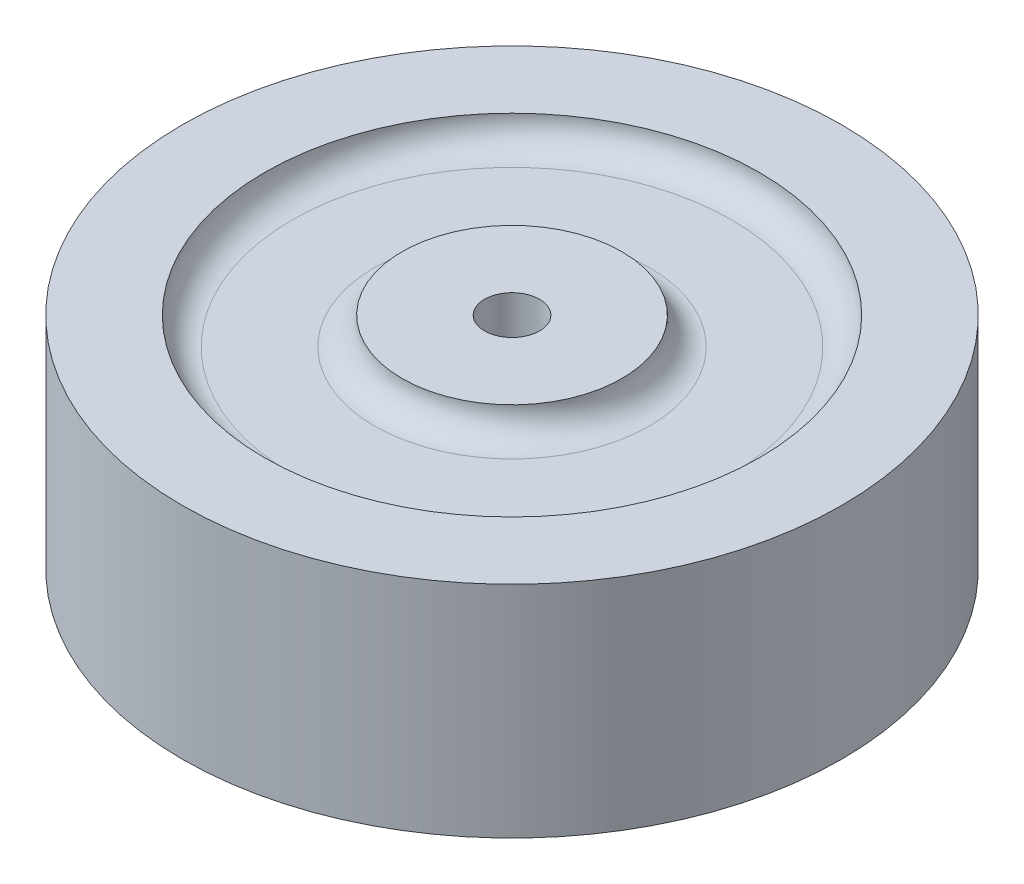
ISO-10303-21;
HEADER;
FILE_DESCRIPTION(('STEP AP214'),'2;1');
FILE_NAME('part.step','',(''),(''),'','','');
FILE_SCHEMA(('AUTOMOTIVE_DESIGN { 1 0 10303 214 1 1 1 1 }'));
ENDSEC;
DATA;
#1=APPLICATION_CONTEXT('core data for automotive mechanical design processes');
#2=APPLICATION_PROTOCOL_DEFINITION('international standard','automotive_design',2000,#1);
#3=PRODUCT_CONTEXT('',#1,'mechanical');
#4=PRODUCT('Part','Part','',(#3));
#5=PRODUCT_RELATED_PRODUCT_CATEGORY('part','',(#4));
#6=PRODUCT_DEFINITION_FORMATION('','',#4);
#7=PRODUCT_DEFINITION_CONTEXT('part definition',#1,'design');
#8=PRODUCT_DEFINITION('design','',#6,#7);
#9=PRODUCT_DEFINITION_SHAPE('','',#8);
#10=(LENGTH_UNIT() NAMED_UNIT(*) SI_UNIT(.MILLI.,.METRE.));
#11=(NAMED_UNIT(*) PLANE_ANGLE_UNIT() SI_UNIT($,.RADIAN.));
#12=(NAMED_UNIT(*) SI_UNIT($,.STERADIAN.) SOLID_ANGLE_UNIT());
#13=UNCERTAINTY_MEASURE_WITH_UNIT(LENGTH_MEASURE(1.E-05),#10,'distance_accuracy_value','');
#14=(GEOMETRIC_REPRESENTATION_CONTEXT(3) GLOBAL_UNCERTAINTY_ASSIGNED_CONTEXT((#13)) GLOBAL_UNIT_ASSIGNED_CONTEXT((#10,
#11,#12)) REPRESENTATION_CONTEXT('',''));
#15=CARTESIAN_POINT('',(0.,0.,0.));
#16=DIRECTION('',(0.,0.,1.));
#17=DIRECTION('',(1.,0.,0.));
#18=AXIS2_PLACEMENT_3D('',#15,#16,#17);
#19=CARTESIAN_POINT('',(0.,0.,0.));
#20=DIRECTION('',(0.,1.,0.));
#21=DIRECTION('',(0.,0.,1.));
#22=AXIS2_PLACEMENT_3D('',#19,#20,#21);
#23=PLANE('',#22);
#24=CARTESIAN_POINT('',(0.,0.,0.));
#25=DIRECTION('',(0.,1.,0.));
#26=DIRECTION('',(0.,0.,1.));
#27=AXIS2_PLACEMENT_3D('',#24,#25,#26);
#28=CIRCLE('',#27,25.4);
#29=CARTESIAN_POINT('',(0.,0.,25.4));
#30=VERTEX_POINT('',#29);
#31=EDGE_CURVE('E10',#30,#30,#28,.F.);
#32=ORIENTED_EDGE('',*,*,#31,.T.);
#33=EDGE_LOOP('',(#32));
#34=FACE_BOUND('',#33,.T.);
#35=CARTESIAN_POINT('',(0.,0.,0.));
#36=DIRECTION('',(0.,1.,0.));
#37=DIRECTION('',(0.,0.,1.));
#38=AXIS2_PLACEMENT_3D('',#35,#36,#37);
#39=CIRCLE('',#38,15.875);
#40=CARTESIAN_POINT('',(0.,0.,15.875));
#41=VERTEX_POINT('',#40);
#42=EDGE_CURVE('E45',#41,#41,#39,.T.);
#43=ORIENTED_EDGE('',*,*,#42,.T.);
#44=EDGE_LOOP('',(#43));
#45=FACE_BOUND('',#44,.T.);
#46=ADVANCED_FACE('F37',(#34,#45),#23,.F.);
#47=CARTESIAN_POINT('',(0.,19.05,0.));
#48=DIRECTION('',(0.,1.,0.));
#49=DIRECTION('',(0.,0.,1.));
#50=AXIS2_PLACEMENT_3D('',#47,#48,#49);
#51=PLANE('',#50);
#52=CARTESIAN_POINT('',(0.,19.05,0.));
#53=DIRECTION('',(0.,1.,0.));
#54=DIRECTION('',(0.,0.,1.));
#55=AXIS2_PLACEMENT_3D('',#52,#53,#54);
#56=CIRCLE('',#55,15.875);
#57=CARTESIAN_POINT('',(0.,19.05,15.875));
#58=VERTEX_POINT('',#57);
#59=EDGE_CURVE('E50',#58,#58,#56,.F.);
#60=ORIENTED_EDGE('',*,*,#59,.T.);
#61=EDGE_LOOP('',(#60));
#62=FACE_BOUND('',#61,.T.);
#63=CARTESIAN_POINT('',(0.,19.05,0.));
#64=DIRECTION('',(0.,1.,0.));
#65=DIRECTION('',(0.,0.,1.));
#66=AXIS2_PLACEMENT_3D('',#63,#64,#65);
#67=CIRCLE('',#66,25.4);
#68=CARTESIAN_POINT('',(0.,19.05,25.4));
#69=VERTEX_POINT('',#68);
#70=EDGE_CURVE('E55',#69,#69,#67,.T.);
#71=ORIENTED_EDGE('',*,*,#70,.T.);
#72=EDGE_LOOP('',(#71));
#73=FACE_BOUND('',#72,.T.);
#74=ADVANCED_FACE('F113',(#62,#73),#51,.T.);
#75=CARTESIAN_POINT('',(0.,19.05,0.));
#76=DIRECTION('',(0.,-1.,0.));
#77=DIRECTION('',(0.,0.,-1.));
#78=AXIS2_PLACEMENT_3D('',#75,#76,#77);
#79=CYLINDRICAL_SURFACE('',#78,38.1);
#80=CARTESIAN_POINT('',(0.,22.225,0.));
#81=DIRECTION('',(0.,1.,0.));
#82=DIRECTION('',(0.,0.,1.));
#83=AXIS2_PLACEMENT_3D('',#80,#81,#82);
#84=CIRCLE('',#83,38.1);
#85=CARTESIAN_POINT('',(0.,22.225,-38.1));
#86=VERTEX_POINT('',#85);
#87=EDGE_CURVE('E61',#86,#86,#84,.T.);
#88=CARTESIAN_POINT('',(0.,-3.175,0.));
#89=DIRECTION('',(0.,-1.,0.));
#90=DIRECTION('',(0.,0.,-1.));
#91=AXIS2_PLACEMENT_3D('',#88,#89,#90);
#92=CIRCLE('',#91,38.1);
#93=CARTESIAN_POINT('',(0.,-3.175,-38.1));
#94=VERTEX_POINT('',#93);
#95=EDGE_CURVE('E69',#94,#94,#92,.T.);
#96=CARTESIAN_POINT('',(0.,22.225,-38.1));
#97=CARTESIAN_POINT('',(0.,21.9604166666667,-38.1));
#98=CARTESIAN_POINT('',(0.,21.6958333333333,-38.1));
#99=CARTESIAN_POINT('',(0.,21.1666666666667,-38.1));
#100=CARTESIAN_POINT('',(0.,20.9020833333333,-38.1));
#101=CARTESIAN_POINT('',(0.,20.3729166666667,-38.1));
#102=CARTESIAN_POINT('',(0.,20.1083333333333,-38.1));
#103=CARTESIAN_POINT('',(0.,19.5791666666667,-38.1));
#104=CARTESIAN_POINT('',(0.,19.3145833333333,-38.1));
#105=CARTESIAN_POINT('',(0.,18.7854166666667,-38.1));
#106=CARTESIAN_POINT('',(0.,18.5208333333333,-38.1));
#107=CARTESIAN_POINT('',(0.,17.9916666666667,-38.1));
#108=CARTESIAN_POINT('',(0.,17.7270833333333,-38.1));
#109=CARTESIAN_POINT('',(0.,17.1979166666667,-38.1));
#110=CARTESIAN_POINT('',(0.,16.9333333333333,-38.1));
#111=CARTESIAN_POINT('',(0.,16.4041666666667,-38.1));
#112=CARTESIAN_POINT('',(0.,16.1395833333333,-38.1));
#113=CARTESIAN_POINT('',(0.,15.6104166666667,-38.1));
#114=CARTESIAN_POINT('',(0.,15.3458333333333,-38.1));
#115=CARTESIAN_POINT('',(0.,14.8166666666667,-38.1));
#116=CARTESIAN_POINT('',(0.,14.5520833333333,-38.1));
#117=CARTESIAN_POINT('',(0.,14.0229166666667,-38.1));
#118=CARTESIAN_POINT('',(0.,13.7583333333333,-38.1));
#119=CARTESIAN_POINT('',(0.,13.2291666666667,-38.1));
#120=CARTESIAN_POINT('',(0.,12.9645833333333,-38.1));
#121=CARTESIAN_POINT('',(0.,12.4354166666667,-38.1));
#122=CARTESIAN_POINT('',(0.,12.1708333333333,-38.1));
#123=CARTESIAN_POINT('',(0.,11.6416666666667,-38.1));
#124=CARTESIAN_POINT('',(0.,11.3770833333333,-38.1));
#125=CARTESIAN_POINT('',(0.,10.8479166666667,-38.1));
#126=CARTESIAN_POINT('',(0.,10.5833333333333,-38.1));
#127=CARTESIAN_POINT('',(0.,10.0541666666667,-38.1));
#128=CARTESIAN_POINT('',(0.,9.78958333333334,-38.1));
#129=CARTESIAN_POINT('',(0.,9.26041666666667,-38.1));
#130=CARTESIAN_POINT('',(0.,8.99583333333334,-38.1));
#131=CARTESIAN_POINT('',(0.,8.46666666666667,-38.1));
#132=CARTESIAN_POINT('',(0.,8.20208333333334,-38.1));
#133=CARTESIAN_POINT('',(0.,7.67291666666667,-38.1));
#134=CARTESIAN_POINT('',(0.,7.40833333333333,-38.1));
#135=CARTESIAN_POINT('',(0.,6.87916666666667,-38.1));
#136=CARTESIAN_POINT('',(0.,6.61458333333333,-38.1));
#137=CARTESIAN_POINT('',(0.,6.08541666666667,-38.1));
#138=CARTESIAN_POINT('',(0.,5.82083333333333,-38.1));
#139=CARTESIAN_POINT('',(0.,5.29166666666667,-38.1));
#140=CARTESIAN_POINT('',(0.,5.02708333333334,-38.1));
#141=CARTESIAN_POINT('',(0.,4.49791666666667,-38.1));
#142=CARTESIAN_POINT('',(0.,4.23333333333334,-38.1));
#143=CARTESIAN_POINT('',(0.,3.70416666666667,-38.1));
#144=CARTESIAN_POINT('',(0.,3.43958333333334,-38.1));
#145=CARTESIAN_POINT('',(0.,2.91041666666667,-38.1));
#146=CARTESIAN_POINT('',(0.,2.64583333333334,-38.1));
#147=CARTESIAN_POINT('',(0.,2.11666666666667,-38.1));
#148=CARTESIAN_POINT('',(0.,1.85208333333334,-38.1));
#149=CARTESIAN_POINT('',(0.,1.32291666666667,-38.1));
#150=CARTESIAN_POINT('',(0.,1.05833333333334,-38.1));
#151=CARTESIAN_POINT('',(0.,0.529166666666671,-38.1));
#152=CARTESIAN_POINT('',(0.,0.264583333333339,-38.1));
#153=CARTESIAN_POINT('',(0.,-0.264583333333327,-38.1));
#154=CARTESIAN_POINT('',(0.,-0.529166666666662,-38.1));
#155=CARTESIAN_POINT('',(0.,-1.05833333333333,-38.1));
#156=CARTESIAN_POINT('',(0.,-1.32291666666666,-38.1));
#157=CARTESIAN_POINT('',(0.,-1.85208333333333,-38.1));
#158=CARTESIAN_POINT('',(0.,-2.11666666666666,-38.1));
#159=CARTESIAN_POINT('',(0.,-2.64583333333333,-38.1));
#160=CARTESIAN_POINT('',(0.,-2.91041666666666,-38.1));
#161=CARTESIAN_POINT('',(0.,-3.175,-38.1));
#162=B_SPLINE_CURVE_WITH_KNOTS('',3,(#96,#97,#98,#99,#100,#101,#102,#103,#104,#105,#106,#107,
#108,#109,#110,#111,#112,#113,#114,#115,#116,#117,#118,#119,#120,#121,#122,#123,#124,#125,#126,
#127,#128,#129,#130,#131,#132,#133,#134,#135,#136,#137,#138,#139,#140,#141,#142,#143,#144,#145,
#146,#147,#148,#149,#150,#151,#152,#153,#154,#155,#156,#157,#158,#159,#160,#161),.UNSPECIFIED.,
.F.,.F.,(4,2,2,2,2,2,2,2,2,2,2,2,2,2,2,2,2,2,2,2,2,2,2,2,2,2,2,2,2,2,2,2,4),(0.,
0.793749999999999,1.5875,2.38125,3.175,3.96875,4.7625,5.55625,6.35,7.14375,7.9375,8.73125,9.525,
10.31875,11.1125,11.90625,12.7,13.49375,14.2875,15.08125,15.875,16.66875,17.4625,18.25625,19.05,
19.84375,20.6375,21.43125,22.225,23.01875,23.8125,24.60625,25.4),.UNSPECIFIED.);
#163=EDGE_CURVE('BSEAM118',#86,#94,#162,.T.);
#164=ORIENTED_EDGE('',*,*,#87,.F.);
#165=ORIENTED_EDGE('',*,*,#95,.F.);
#166=ORIENTED_EDGE('',*,*,#163,.T.);
#167=ORIENTED_EDGE('',*,*,#163,.F.);
#168=EDGE_LOOP('',(#164,#166,#165,#167));
#169=FACE_BOUND('',#168,.T.);
#170=ADVANCED_FACE('F118',(#169),#79,.T.);
#171=CARTESIAN_POINT('',(0.,19.05,0.));
#172=DIRECTION('',(0.,-1.,0.));
#173=DIRECTION('',(0.,0.,-1.));
#174=AXIS2_PLACEMENT_3D('',#171,#172,#173);
#175=CYLINDRICAL_SURFACE('',#174,3.175);
#176=CARTESIAN_POINT('',(0.,22.225,0.));
#177=DIRECTION('',(0.,1.,0.));
#178=DIRECTION('',(0.,0.,1.));
#179=AXIS2_PLACEMENT_3D('',#176,#177,#178);
#180=CIRCLE('',#179,3.175);
#181=CARTESIAN_POINT('',(0.,22.225,-3.175));
#182=VERTEX_POINT('',#181);
#183=EDGE_CURVE('E81',#182,#182,#180,.T.);
#184=CARTESIAN_POINT('',(0.,-3.175,0.));
#185=DIRECTION('',(0.,-1.,0.));
#186=DIRECTION('',(0.,0.,-1.));
#187=AXIS2_PLACEMENT_3D('',#184,#185,#186);
#188=CIRCLE('',#187,3.175);
#189=CARTESIAN_POINT('',(0.,-3.175,-3.175));
#190=VERTEX_POINT('',#189);
#191=EDGE_CURVE('E89',#190,#190,#188,.T.);
#192=CARTESIAN_POINT('',(0.,22.225,-3.175));
#193=CARTESIAN_POINT('',(0.,21.9604166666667,-3.175));
#194=CARTESIAN_POINT('',(0.,21.6958333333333,-3.175));
#195=CARTESIAN_POINT('',(0.,21.1666666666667,-3.175));
#196=CARTESIAN_POINT('',(0.,20.9020833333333,-3.175));
#197=CARTESIAN_POINT('',(0.,20.3729166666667,-3.175));
#198=CARTESIAN_POINT('',(0.,20.1083333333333,-3.175));
#199=CARTESIAN_POINT('',(0.,19.5791666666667,-3.175));
#200=CARTESIAN_POINT('',(0.,19.3145833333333,-3.175));
#201=CARTESIAN_POINT('',(0.,18.7854166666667,-3.175));
#202=CARTESIAN_POINT('',(0.,18.5208333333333,-3.175));
#203=CARTESIAN_POINT('',(0.,17.9916666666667,-3.175));
#204=CARTESIAN_POINT('',(0.,17.7270833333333,-3.175));
#205=CARTESIAN_POINT('',(0.,17.1979166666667,-3.175));
#206=CARTESIAN_POINT('',(0.,16.9333333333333,-3.175));
#207=CARTESIAN_POINT('',(0.,16.4041666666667,-3.175));
#208=CARTESIAN_POINT('',(0.,16.1395833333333,-3.175));
#209=CARTESIAN_POINT('',(0.,15.6104166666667,-3.175));
#210=CARTESIAN_POINT('',(0.,15.3458333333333,-3.175));
#211=CARTESIAN_POINT('',(0.,14.8166666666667,-3.175));
#212=CARTESIAN_POINT('',(0.,14.5520833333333,-3.175));
#213=CARTESIAN_POINT('',(0.,14.0229166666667,-3.175));
#214=CARTESIAN_POINT('',(0.,13.7583333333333,-3.175));
#215=CARTESIAN_POINT('',(0.,13.2291666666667,-3.175));
#216=CARTESIAN_POINT('',(0.,12.9645833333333,-3.175));
#217=CARTESIAN_POINT('',(0.,12.4354166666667,-3.175));
#218=CARTESIAN_POINT('',(0.,12.1708333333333,-3.175));
#219=CARTESIAN_POINT('',(0.,11.6416666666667,-3.175));
#220=CARTESIAN_POINT('',(0.,11.3770833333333,-3.175));
#221=CARTESIAN_POINT('',(0.,10.8479166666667,-3.175));
#222=CARTESIAN_POINT('',(0.,10.5833333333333,-3.175));
#223=CARTESIAN_POINT('',(0.,10.0541666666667,-3.175));
#224=CARTESIAN_POINT('',(0.,9.78958333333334,-3.175));
#225=CARTESIAN_POINT('',(0.,9.26041666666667,-3.175));
#226=CARTESIAN_POINT('',(0.,8.99583333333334,-3.175));
#227=CARTESIAN_POINT('',(0.,8.46666666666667,-3.175));
#228=CARTESIAN_POINT('',(0.,8.20208333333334,-3.175));
#229=CARTESIAN_POINT('',(0.,7.67291666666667,-3.175));
#230=CARTESIAN_POINT('',(0.,7.40833333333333,-3.175));
#231=CARTESIAN_POINT('',(0.,6.87916666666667,-3.175));
#232=CARTESIAN_POINT('',(0.,6.61458333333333,-3.175));
#233=CARTESIAN_POINT('',(0.,6.08541666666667,-3.175));
#234=CARTESIAN_POINT('',(0.,5.82083333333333,-3.175));
#235=CARTESIAN_POINT('',(0.,5.29166666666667,-3.175));
#236=CARTESIAN_POINT('',(0.,5.02708333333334,-3.175));
#237=CARTESIAN_POINT('',(0.,4.49791666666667,-3.175));
#238=CARTESIAN_POINT('',(0.,4.23333333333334,-3.175));
#239=CARTESIAN_POINT('',(0.,3.70416666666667,-3.175));
#240=CARTESIAN_POINT('',(0.,3.43958333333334,-3.175));
#241=CARTESIAN_POINT('',(0.,2.91041666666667,-3.175));
#242=CARTESIAN_POINT('',(0.,2.64583333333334,-3.175));
#243=CARTESIAN_POINT('',(0.,2.11666666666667,-3.175));
#244=CARTESIAN_POINT('',(0.,1.85208333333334,-3.175));
#245=CARTESIAN_POINT('',(0.,1.32291666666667,-3.175));
#246=CARTESIAN_POINT('',(0.,1.05833333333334,-3.175));
#247=CARTESIAN_POINT('',(0.,0.529166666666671,-3.175));
#248=CARTESIAN_POINT('',(0.,0.264583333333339,-3.175));
#249=CARTESIAN_POINT('',(0.,-0.264583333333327,-3.175));
#250=CARTESIAN_POINT('',(0.,-0.529166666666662,-3.175));
#251=CARTESIAN_POINT('',(0.,-1.05833333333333,-3.175));
#252=CARTESIAN_POINT('',(0.,-1.32291666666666,-3.175));
#253=CARTESIAN_POINT('',(0.,-1.85208333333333,-3.175));
#254=CARTESIAN_POINT('',(0.,-2.11666666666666,-3.175));
#255=CARTESIAN_POINT('',(0.,-2.64583333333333,-3.175));
#256=CARTESIAN_POINT('',(0.,-2.91041666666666,-3.175));
#257=CARTESIAN_POINT('',(0.,-3.175,-3.175));
#258=B_SPLINE_CURVE_WITH_KNOTS('',3,(#192,#193,#194,#195,#196,#197,#198,#199,#200,#201,#202,
#203,#204,#205,#206,#207,#208,#209,#210,#211,#212,#213,#214,#215,#216,#217,#218,#219,#220,#221,
#222,#223,#224,#225,#226,#227,#228,#229,#230,#231,#232,#233,#234,#235,#236,#237,#238,#239,#240,
#241,#242,#243,#244,#245,#246,#247,#248,#249,#250,#251,#252,#253,#254,#255,#256,#257),
.UNSPECIFIED.,.F.,.F.,(4,2,2,2,2,2,2,2,2,2,2,2,2,2,2,2,2,2,2,2,2,2,2,2,2,2,2,2,2,2,2,2,4),(0.,
0.793749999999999,1.5875,2.38125,3.175,3.96875,4.7625,5.55625,6.35,7.14375,7.9375,8.73125,9.525,
10.31875,11.1125,11.90625,12.7,13.49375,14.2875,15.08125,15.875,16.66875,17.4625,18.25625,19.05,
19.84375,20.6375,21.43125,22.225,23.01875,23.8125,24.60625,25.4),.UNSPECIFIED.);
#259=EDGE_CURVE('BSEAM94',#182,#190,#258,.T.);
#260=ORIENTED_EDGE('',*,*,#183,.T.);
#261=ORIENTED_EDGE('',*,*,#191,.T.);
#262=ORIENTED_EDGE('',*,*,#259,.T.);
#263=ORIENTED_EDGE('',*,*,#259,.F.);
#264=EDGE_LOOP('',(#260,#262,#261,#263));
#265=FACE_BOUND('',#264,.T.);
#266=ADVANCED_FACE('F94',(#265),#175,.F.);
#267=CARTESIAN_POINT('',(0.,22.225,0.));
#268=DIRECTION('',(0.,1.,0.));
#269=DIRECTION('',(0.,0.,1.));
#270=AXIS2_PLACEMENT_3D('',#267,#268,#269);
#271=PLANE('',#270);
#272=ORIENTED_EDGE('',*,*,#87,.T.);
#273=EDGE_LOOP('',(#272));
#274=FACE_BOUND('',#273,.T.);
#275=CARTESIAN_POINT('',(0.,22.225,0.));
#276=DIRECTION('',(0.,1.,0.));
#277=DIRECTION('',(0.,0.,1.));
#278=AXIS2_PLACEMENT_3D('',#275,#276,#277);
#279=CIRCLE('',#278,28.575);
#280=CARTESIAN_POINT('',(0.,22.225,28.575));
#281=VERTEX_POINT('',#280);
#282=EDGE_CURVE('E65',#281,#281,#279,.T.);
#283=ORIENTED_EDGE('',*,*,#282,.F.);
#284=EDGE_LOOP('',(#283));
#285=FACE_BOUND('',#284,.T.);
#286=ADVANCED_FACE('F139',(#274,#285),#271,.T.);
#287=CARTESIAN_POINT('',(0.,-3.175,0.));
#288=DIRECTION('',(0.,-1.,0.));
#289=DIRECTION('',(0.,0.,-1.));
#290=AXIS2_PLACEMENT_3D('',#287,#288,#289);
#291=PLANE('',#290);
#292=ORIENTED_EDGE('',*,*,#95,.T.);
#293=EDGE_LOOP('',(#292));
#294=FACE_BOUND('',#293,.T.);
#295=CARTESIAN_POINT('',(0.,-3.175,0.));
#296=DIRECTION('',(0.,-1.,0.));
#297=DIRECTION('',(0.,0.,-1.));
#298=AXIS2_PLACEMENT_3D('',#295,#296,#297);
#299=CIRCLE('',#298,28.575);
#300=CARTESIAN_POINT('',(0.,-3.175,-28.575));
#301=VERTEX_POINT('',#300);
#302=EDGE_CURVE('E73',#301,#301,#299,.T.);
#303=ORIENTED_EDGE('',*,*,#302,.F.);
#304=EDGE_LOOP('',(#303));
#305=FACE_BOUND('',#304,.T.);
#306=ADVANCED_FACE('F109',(#294,#305),#291,.T.);
#307=CARTESIAN_POINT('',(0.,22.225,0.));
#308=DIRECTION('',(0.,1.,0.));
#309=DIRECTION('',(0.,0.,1.));
#310=AXIS2_PLACEMENT_3D('',#307,#308,#309);
#311=PLANE('',#310);
#312=CARTESIAN_POINT('',(0.,22.225,0.));
#313=DIRECTION('',(0.,1.,0.));
#314=DIRECTION('',(0.,0.,1.));
#315=AXIS2_PLACEMENT_3D('',#312,#313,#314);
#316=CIRCLE('',#315,12.7);
#317=CARTESIAN_POINT('',(0.,22.225,12.7));
#318=VERTEX_POINT('',#317);
#319=EDGE_CURVE('E77',#318,#318,#316,.T.);
#320=ORIENTED_EDGE('',*,*,#319,.T.);
#321=EDGE_LOOP('',(#320));
#322=FACE_BOUND('',#321,.T.);
#323=ORIENTED_EDGE('',*,*,#183,.F.);
#324=EDGE_LOOP('',(#323));
#325=FACE_BOUND('',#324,.T.);
#326=ADVANCED_FACE('F99',(#322,#325),#311,.T.);
#327=CARTESIAN_POINT('',(0.,-3.175,0.));
#328=DIRECTION('',(0.,-1.,0.));
#329=DIRECTION('',(0.,0.,-1.));
#330=AXIS2_PLACEMENT_3D('',#327,#328,#329);
#331=PLANE('',#330);
#332=CARTESIAN_POINT('',(0.,-3.175,0.));
#333=DIRECTION('',(0.,-1.,0.));
#334=DIRECTION('',(0.,0.,-1.));
#335=AXIS2_PLACEMENT_3D('',#332,#333,#334);
#336=CIRCLE('',#335,12.7);
#337=CARTESIAN_POINT('',(0.,-3.175,-12.7));
#338=VERTEX_POINT('',#337);
#339=EDGE_CURVE('E85',#338,#338,#336,.T.);
#340=ORIENTED_EDGE('',*,*,#339,.T.);
#341=EDGE_LOOP('',(#340));
#342=FACE_BOUND('',#341,.T.);
#343=ORIENTED_EDGE('',*,*,#191,.F.);
#344=EDGE_LOOP('',(#343));
#345=FACE_BOUND('',#344,.T.);
#346=ADVANCED_FACE('F96',(#342,#345),#331,.T.);
#347=CARTESIAN_POINT('',(0.,22.225,0.));
#348=DIRECTION('',(0.,1.,0.));
#349=DIRECTION('',(0.,0.,1.));
#350=AXIS2_PLACEMENT_3D('',#347,#348,#349);
#351=TOROIDAL_SURFACE('',#350,15.875,3.175);
#352=ORIENTED_EDGE('',*,*,#59,.F.);
#353=EDGE_LOOP('',(#352));
#354=FACE_BOUND('',#353,.T.);
#355=ORIENTED_EDGE('',*,*,#319,.F.);
#356=EDGE_LOOP('',(#355));
#357=FACE_BOUND('',#356,.T.);
#358=ADVANCED_FACE('F98',(#354,#357),#351,.F.);
#359=CARTESIAN_POINT('',(0.,22.225,0.));
#360=DIRECTION('',(0.,1.,0.));
#361=DIRECTION('',(0.,0.,1.));
#362=AXIS2_PLACEMENT_3D('',#359,#360,#361);
#363=TOROIDAL_SURFACE('',#362,25.4,3.175);
#364=ORIENTED_EDGE('',*,*,#70,.F.);
#365=EDGE_LOOP('',(#364));
#366=FACE_BOUND('',#365,.T.);
#367=ORIENTED_EDGE('',*,*,#282,.T.);
#368=EDGE_LOOP('',(#367));
#369=FACE_BOUND('',#368,.T.);
#370=ADVANCED_FACE('F106',(#366,#369),#363,.F.);
#371=CARTESIAN_POINT('',(0.,-3.175,0.));
#372=DIRECTION('',(0.,1.,0.));
#373=DIRECTION('',(0.,0.,1.));
#374=AXIS2_PLACEMENT_3D('',#371,#372,#373);
#375=TOROIDAL_SURFACE('',#374,25.4,3.175);
#376=ORIENTED_EDGE('',*,*,#302,.T.);
#377=EDGE_LOOP('',(#376));
#378=FACE_BOUND('',#377,.T.);
#379=ORIENTED_EDGE('',*,*,#31,.F.);
#380=EDGE_LOOP('',(#379));
#381=FACE_BOUND('',#380,.T.);
#382=ADVANCED_FACE('F127',(#378,#381),#375,.F.);
#383=CARTESIAN_POINT('',(0.,-3.175,0.));
#384=DIRECTION('',(0.,1.,0.));
#385=DIRECTION('',(0.,0.,1.));
#386=AXIS2_PLACEMENT_3D('',#383,#384,#385);
#387=TOROIDAL_SURFACE('',#386,15.875,3.175);
#388=ORIENTED_EDGE('',*,*,#42,.F.);
#389=EDGE_LOOP('',(#388));
#390=FACE_BOUND('',#389,.T.);
#391=ORIENTED_EDGE('',*,*,#339,.F.);
#392=EDGE_LOOP('',(#391));
#393=FACE_BOUND('',#392,.T.);
#394=ADVANCED_FACE('F39',(#390,#393),#387,.F.);
#395=CLOSED_SHELL('',(#46,#74,#170,#266,#286,#306,#326,#346,#358,#370,#382,#394));
#396=MANIFOLD_SOLID_BREP('B2',#395);
#397=ADVANCED_BREP_SHAPE_REPRESENTATION('',(#18,#396),#14);
#398=SHAPE_DEFINITION_REPRESENTATION(#9,#397);
ENDSEC;
END-ISO-10303-21;
